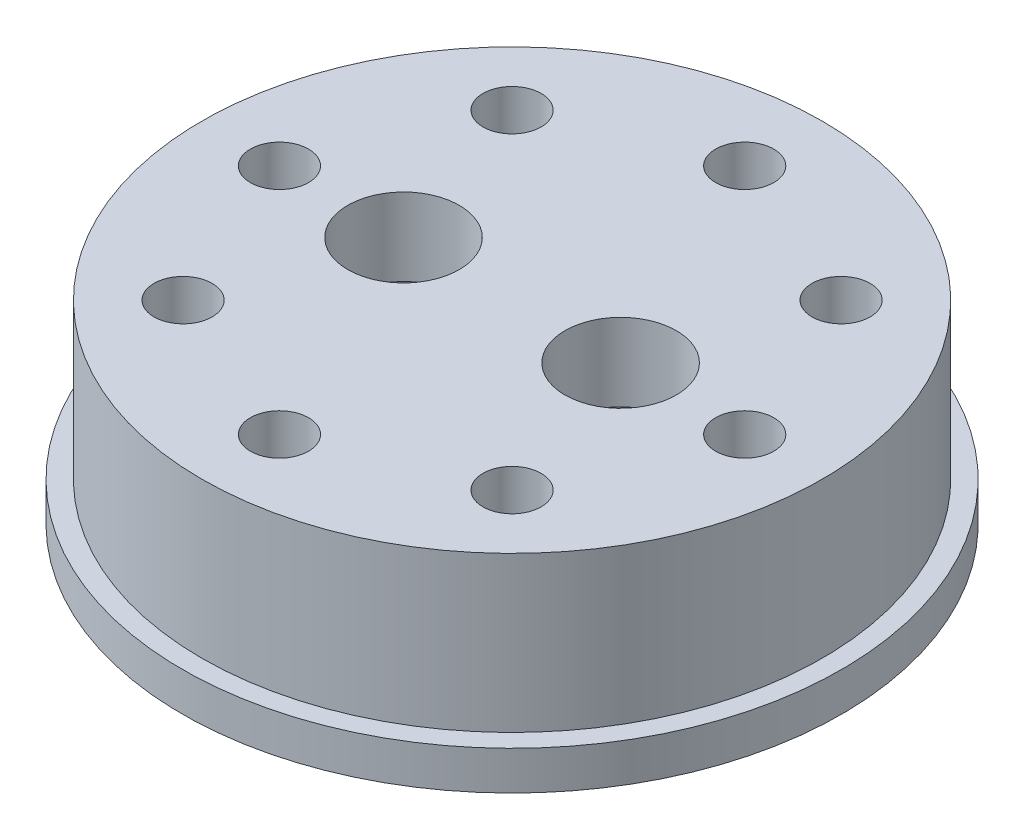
ISO-10303-21;
HEADER;
FILE_DESCRIPTION(('STEP AP214'),'2;1');
FILE_NAME('part.step','',(''),(''),'','','');
FILE_SCHEMA(('AUTOMOTIVE_DESIGN { 1 0 10303 214 1 1 1 1 }'));
ENDSEC;
DATA;
#1=APPLICATION_CONTEXT('core data for automotive mechanical design processes');
#2=APPLICATION_PROTOCOL_DEFINITION('international standard','automotive_design',2000,#1);
#3=PRODUCT_CONTEXT('',#1,'mechanical');
#4=PRODUCT('Part','Part','',(#3));
#5=PRODUCT_RELATED_PRODUCT_CATEGORY('part','',(#4));
#6=PRODUCT_DEFINITION_FORMATION('','',#4);
#7=PRODUCT_DEFINITION_CONTEXT('part definition',#1,'design');
#8=PRODUCT_DEFINITION('design','',#6,#7);
#9=PRODUCT_DEFINITION_SHAPE('','',#8);
#10=(LENGTH_UNIT() NAMED_UNIT(*) SI_UNIT(.MILLI.,.METRE.));
#11=(NAMED_UNIT(*) PLANE_ANGLE_UNIT() SI_UNIT($,.RADIAN.));
#12=(NAMED_UNIT(*) SI_UNIT($,.STERADIAN.) SOLID_ANGLE_UNIT());
#13=UNCERTAINTY_MEASURE_WITH_UNIT(LENGTH_MEASURE(1.E-05),#10,'distance_accuracy_value','');
#14=(GEOMETRIC_REPRESENTATION_CONTEXT(3) GLOBAL_UNCERTAINTY_ASSIGNED_CONTEXT((#13)) GLOBAL_UNIT_ASSIGNED_CONTEXT((#10,
#11,#12)) REPRESENTATION_CONTEXT('',''));
#15=CARTESIAN_POINT('',(0.,0.,0.));
#16=DIRECTION('',(0.,0.,1.));
#17=DIRECTION('',(1.,0.,0.));
#18=AXIS2_PLACEMENT_3D('',#15,#16,#17);
#19=CARTESIAN_POINT('',(0.,31.75,0.));
#20=DIRECTION('',(0.,-1.,0.));
#21=DIRECTION('',(0.,0.,-1.));
#22=AXIS2_PLACEMENT_3D('',#19,#20,#21);
#23=CYLINDRICAL_SURFACE('',#22,30.48);
#24=DIRECTION('',(0.,-1.,0.));
#25=VECTOR('',#24,1.);
#26=CARTESIAN_POINT('',(-9.906,31.75,-28.8253632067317));
#27=LINE('',#26,#25);
#28=CARTESIAN_POINT('',(-9.906,0.,-28.8253632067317));
#29=VERTEX_POINT('',#28);
#30=CARTESIAN_POINT('',(-9.906,19.05,-28.8253632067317));
#31=VERTEX_POINT('',#30);
#32=EDGE_CURVE('E289',#29,#31,#27,.F.);
#33=ORIENTED_EDGE('',*,*,#32,.T.);
#34=CARTESIAN_POINT('',(0.,19.05,0.));
#35=DIRECTION('',(0.,1.,0.));
#36=DIRECTION('',(0.,0.,1.));
#37=AXIS2_PLACEMENT_3D('',#34,#35,#36);
#38=CIRCLE('',#37,30.48);
#39=CARTESIAN_POINT('',(-9.906,19.05,28.8253632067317));
#40=VERTEX_POINT('',#39);
#41=EDGE_CURVE('E179',#31,#40,#38,.T.);
#42=ORIENTED_EDGE('',*,*,#41,.T.);
#43=DIRECTION('',(0.,-1.,0.));
#44=VECTOR('',#43,1.);
#45=CARTESIAN_POINT('',(-9.906,31.75,28.8253632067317));
#46=LINE('',#45,#44);
#47=CARTESIAN_POINT('',(-9.906,0.,28.8253632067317));
#48=VERTEX_POINT('',#47);
#49=EDGE_CURVE('E293',#40,#48,#46,.T.);
#50=ORIENTED_EDGE('',*,*,#49,.T.);
#51=CARTESIAN_POINT('',(0.,0.,0.));
#52=DIRECTION('',(0.,1.,0.));
#53=DIRECTION('',(0.,0.,1.));
#54=AXIS2_PLACEMENT_3D('',#51,#52,#53);
#55=CIRCLE('',#54,30.48);
#56=EDGE_CURVE('E270',#29,#48,#55,.T.);
#57=ORIENTED_EDGE('',*,*,#56,.F.);
#58=EDGE_LOOP('',(#33,#42,#50,#57));
#59=FACE_BOUND('',#58,.T.);
#60=ADVANCED_FACE('F72',(#59),#23,.F.);
#61=DIRECTION('',(0.,-1.,0.));
#62=VECTOR('',#61,1.);
#63=CARTESIAN_POINT('',(9.906,31.75,28.8253632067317));
#64=LINE('',#63,#62);
#65=CARTESIAN_POINT('',(9.906,0.,28.8253632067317));
#66=VERTEX_POINT('',#65);
#67=CARTESIAN_POINT('',(9.906,19.05,28.8253632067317));
#68=VERTEX_POINT('',#67);
#69=EDGE_CURVE('E149',#66,#68,#64,.F.);
#70=ORIENTED_EDGE('',*,*,#69,.T.);
#71=CARTESIAN_POINT('',(0.,19.05,0.));
#72=DIRECTION('',(0.,1.,0.));
#73=DIRECTION('',(0.,0.,1.));
#74=AXIS2_PLACEMENT_3D('',#71,#72,#73);
#75=CIRCLE('',#74,30.48);
#76=CARTESIAN_POINT('',(9.906,19.05,-28.8253632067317));
#77=VERTEX_POINT('',#76);
#78=EDGE_CURVE('E153',#68,#77,#75,.T.);
#79=ORIENTED_EDGE('',*,*,#78,.T.);
#80=DIRECTION('',(0.,-1.,0.));
#81=VECTOR('',#80,1.);
#82=CARTESIAN_POINT('',(9.906,31.75,-28.8253632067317));
#83=LINE('',#82,#81);
#84=CARTESIAN_POINT('',(9.906,0.,-28.8253632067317));
#85=VERTEX_POINT('',#84);
#86=EDGE_CURVE('E141',#77,#85,#83,.T.);
#87=ORIENTED_EDGE('',*,*,#86,.T.);
#88=EDGE_CURVE('E208',#66,#85,#55,.T.);
#89=ORIENTED_EDGE('',*,*,#88,.F.);
#90=EDGE_LOOP('',(#70,#79,#87,#89));
#91=FACE_BOUND('',#90,.T.);
#92=ADVANCED_FACE('F154',(#91),#23,.F.);
#93=CARTESIAN_POINT('',(3.175,0.,0.));
#94=DIRECTION('',(1.,0.,0.));
#95=DIRECTION('',(0.,0.,-1.));
#96=AXIS2_PLACEMENT_3D('',#93,#94,#95);
#97=PLANE('',#96);
#98=DIRECTION('',(0.,1.,0.));
#99=VECTOR('',#98,1.);
#100=CARTESIAN_POINT('',(3.175,31.75,-24.0211360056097));
#101=LINE('',#100,#99);
#102=CARTESIAN_POINT('',(3.175,0.,-24.0211360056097));
#103=VERTEX_POINT('',#102);
#104=CARTESIAN_POINT('',(3.175,19.05,-24.0211360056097));
#105=VERTEX_POINT('',#104);
#106=EDGE_CURVE('E276',#103,#105,#101,.T.);
#107=ORIENTED_EDGE('',*,*,#106,.T.);
#108=DIRECTION('',(0.,0.,1.));
#109=VECTOR('',#108,1.);
#110=CARTESIAN_POINT('',(3.175,19.05,0.));
#111=LINE('',#110,#109);
#112=CARTESIAN_POINT('',(3.175,19.05,24.0211360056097));
#113=VERTEX_POINT('',#112);
#114=EDGE_CURVE('E98',#105,#113,#111,.T.);
#115=ORIENTED_EDGE('',*,*,#114,.T.);
#116=DIRECTION('',(0.,1.,0.));
#117=VECTOR('',#116,1.);
#118=CARTESIAN_POINT('',(3.175,0.,24.0211360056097));
#119=LINE('',#118,#117);
#120=CARTESIAN_POINT('',(3.175,0.,24.0211360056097));
#121=VERTEX_POINT('',#120);
#122=EDGE_CURVE('E279',#113,#121,#119,.F.);
#123=ORIENTED_EDGE('',*,*,#122,.T.);
#124=DIRECTION('',(0.,0.,-1.));
#125=VECTOR('',#124,1.);
#126=CARTESIAN_POINT('',(3.175,0.,0.));
#127=LINE('',#126,#125);
#128=EDGE_CURVE('E195',#121,#103,#127,.T.);
#129=ORIENTED_EDGE('',*,*,#128,.T.);
#130=EDGE_LOOP('',(#107,#115,#123,#129));
#131=FACE_BOUND('',#130,.T.);
#132=ADVANCED_FACE('F336',(#131),#97,.T.);
#133=CARTESIAN_POINT('',(-3.175,0.,30.3141843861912));
#134=DIRECTION('',(1.,0.,0.));
#135=DIRECTION('',(0.,0.,-1.));
#136=AXIS2_PLACEMENT_3D('',#133,#134,#135);
#137=PLANE('',#136);
#138=DIRECTION('',(0.,0.,1.));
#139=VECTOR('',#138,1.);
#140=CARTESIAN_POINT('',(-3.175,19.05,30.3141843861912));
#141=LINE('',#140,#139);
#142=CARTESIAN_POINT('',(-3.175,19.05,-24.0211360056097));
#143=VERTEX_POINT('',#142);
#144=CARTESIAN_POINT('',(-3.175,19.05,24.0211360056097));
#145=VERTEX_POINT('',#144);
#146=EDGE_CURVE('E175',#143,#145,#141,.T.);
#147=ORIENTED_EDGE('',*,*,#146,.F.);
#148=DIRECTION('',(0.,-1.,0.));
#149=VECTOR('',#148,1.);
#150=CARTESIAN_POINT('',(-3.175,0.,-24.0211360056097));
#151=LINE('',#150,#149);
#152=CARTESIAN_POINT('',(-3.175,0.,-24.0211360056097));
#153=VERTEX_POINT('',#152);
#154=EDGE_CURVE('E282',#143,#153,#151,.T.);
#155=ORIENTED_EDGE('',*,*,#154,.T.);
#156=DIRECTION('',(0.,0.,-1.));
#157=VECTOR('',#156,1.);
#158=CARTESIAN_POINT('',(-3.175,0.,30.3141843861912));
#159=LINE('',#158,#157);
#160=CARTESIAN_POINT('',(-3.175,0.,24.0211360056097));
#161=VERTEX_POINT('',#160);
#162=EDGE_CURVE('E191',#161,#153,#159,.T.);
#163=ORIENTED_EDGE('',*,*,#162,.F.);
#164=DIRECTION('',(0.,-1.,0.));
#165=VECTOR('',#164,1.);
#166=CARTESIAN_POINT('',(-3.175,0.,24.0211360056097));
#167=LINE('',#166,#165);
#168=EDGE_CURVE('E285',#161,#145,#167,.F.);
#169=ORIENTED_EDGE('',*,*,#168,.T.);
#170=EDGE_LOOP('',(#147,#155,#163,#169));
#171=FACE_BOUND('',#170,.T.);
#172=ADVANCED_FACE('F370',(#171),#137,.F.);
#173=CARTESIAN_POINT('',(8.255,31.75,24.0211360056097));
#174=DIRECTION('',(0.,-1.,0.));
#175=DIRECTION('',(0.,0.,-1.));
#176=AXIS2_PLACEMENT_3D('',#173,#174,#175);
#177=CYLINDRICAL_SURFACE('',#176,5.08);
#178=CARTESIAN_POINT('',(8.255,19.05,24.0211360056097));
#179=DIRECTION('',(0.,1.,0.));
#180=DIRECTION('',(0.,0.,1.));
#181=AXIS2_PLACEMENT_3D('',#178,#179,#180);
#182=CIRCLE('',#181,5.08);
#183=EDGE_CURVE('E90',#68,#113,#182,.F.);
#184=ORIENTED_EDGE('',*,*,#183,.F.);
#185=ORIENTED_EDGE('',*,*,#69,.F.);
#186=CARTESIAN_POINT('',(8.255,0.,24.0211360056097));
#187=DIRECTION('',(0.,1.,0.));
#188=DIRECTION('',(0.,0.,1.));
#189=AXIS2_PLACEMENT_3D('',#186,#187,#188);
#190=CIRCLE('',#189,5.08);
#191=EDGE_CURVE('E296',#121,#66,#190,.T.);
#192=ORIENTED_EDGE('',*,*,#191,.F.);
#193=ORIENTED_EDGE('',*,*,#122,.F.);
#194=EDGE_LOOP('',(#184,#185,#192,#193));
#195=FACE_BOUND('',#194,.T.);
#196=ADVANCED_FACE('F366',(#195),#177,.F.);
#197=CARTESIAN_POINT('',(-8.255,31.75,24.0211360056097));
#198=DIRECTION('',(0.,-1.,0.));
#199=DIRECTION('',(0.,0.,-1.));
#200=AXIS2_PLACEMENT_3D('',#197,#198,#199);
#201=CYLINDRICAL_SURFACE('',#200,5.08);
#202=CARTESIAN_POINT('',(-8.255,19.05,24.0211360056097));
#203=DIRECTION('',(0.,1.,0.));
#204=DIRECTION('',(0.,0.,1.));
#205=AXIS2_PLACEMENT_3D('',#202,#203,#204);
#206=CIRCLE('',#205,5.08);
#207=EDGE_CURVE('E182',#145,#40,#206,.F.);
#208=ORIENTED_EDGE('',*,*,#207,.F.);
#209=ORIENTED_EDGE('',*,*,#168,.F.);
#210=CARTESIAN_POINT('',(-8.255,0.,24.0211360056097));
#211=DIRECTION('',(0.,1.,0.));
#212=DIRECTION('',(0.,0.,1.));
#213=AXIS2_PLACEMENT_3D('',#210,#211,#212);
#214=CIRCLE('',#213,5.08);
#215=EDGE_CURVE('E299',#48,#161,#214,.T.);
#216=ORIENTED_EDGE('',*,*,#215,.F.);
#217=ORIENTED_EDGE('',*,*,#49,.F.);
#218=EDGE_LOOP('',(#208,#209,#216,#217));
#219=FACE_BOUND('',#218,.T.);
#220=ADVANCED_FACE('F369',(#219),#201,.F.);
#221=CARTESIAN_POINT('',(-8.255,31.75,-24.0211360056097));
#222=DIRECTION('',(0.,-1.,0.));
#223=DIRECTION('',(0.,0.,-1.));
#224=AXIS2_PLACEMENT_3D('',#221,#222,#223);
#225=CYLINDRICAL_SURFACE('',#224,5.08);
#226=CARTESIAN_POINT('',(-8.255,19.05,-24.0211360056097));
#227=DIRECTION('',(0.,1.,0.));
#228=DIRECTION('',(0.,0.,1.));
#229=AXIS2_PLACEMENT_3D('',#226,#227,#228);
#230=CIRCLE('',#229,5.08);
#231=EDGE_CURVE('E171',#31,#143,#230,.F.);
#232=ORIENTED_EDGE('',*,*,#231,.F.);
#233=ORIENTED_EDGE('',*,*,#32,.F.);
#234=CARTESIAN_POINT('',(-8.255,0.,-24.0211360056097));
#235=DIRECTION('',(0.,1.,0.));
#236=DIRECTION('',(0.,0.,1.));
#237=AXIS2_PLACEMENT_3D('',#234,#235,#236);
#238=CIRCLE('',#237,5.08);
#239=EDGE_CURVE('E302',#153,#29,#238,.T.);
#240=ORIENTED_EDGE('',*,*,#239,.F.);
#241=ORIENTED_EDGE('',*,*,#154,.F.);
#242=EDGE_LOOP('',(#232,#233,#240,#241));
#243=FACE_BOUND('',#242,.T.);
#244=ADVANCED_FACE('F327',(#243),#225,.F.);
#245=CARTESIAN_POINT('',(8.255,31.75,-24.0211360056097));
#246=DIRECTION('',(0.,-1.,0.));
#247=DIRECTION('',(0.,0.,-1.));
#248=AXIS2_PLACEMENT_3D('',#245,#246,#247);
#249=CYLINDRICAL_SURFACE('',#248,5.08);
#250=CARTESIAN_POINT('',(8.255,19.05,-24.0211360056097));
#251=DIRECTION('',(0.,1.,0.));
#252=DIRECTION('',(0.,0.,1.));
#253=AXIS2_PLACEMENT_3D('',#250,#251,#252);
#254=CIRCLE('',#253,5.08);
#255=EDGE_CURVE('E12',#105,#77,#254,.F.);
#256=ORIENTED_EDGE('',*,*,#255,.F.);
#257=ORIENTED_EDGE('',*,*,#106,.F.);
#258=CARTESIAN_POINT('',(8.255,0.,-24.0211360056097));
#259=DIRECTION('',(0.,1.,0.));
#260=DIRECTION('',(0.,0.,1.));
#261=AXIS2_PLACEMENT_3D('',#258,#259,#260);
#262=CIRCLE('',#261,5.08);
#263=EDGE_CURVE('E144',#85,#103,#262,.T.);
#264=ORIENTED_EDGE('',*,*,#263,.F.);
#265=ORIENTED_EDGE('',*,*,#86,.F.);
#266=EDGE_LOOP('',(#256,#257,#264,#265));
#267=FACE_BOUND('',#266,.T.);
#268=ADVANCED_FACE('F74',(#267),#249,.F.);
#269=CARTESIAN_POINT('',(0.,31.75,0.));
#270=DIRECTION('',(0.,-1.,0.));
#271=DIRECTION('',(0.,0.,-1.));
#272=AXIS2_PLACEMENT_3D('',#269,#270,#271);
#273=CYLINDRICAL_SURFACE('',#272,50.8);
#274=CARTESIAN_POINT('',(0.,31.75,0.));
#275=DIRECTION('',(0.,1.,0.));
#276=DIRECTION('',(0.,0.,1.));
#277=AXIS2_PLACEMENT_3D('',#274,#275,#276);
#278=CIRCLE('',#277,50.8);
#279=CARTESIAN_POINT('',(0.,31.75,50.8));
#280=VERTEX_POINT('',#279);
#281=EDGE_CURVE('E150',#280,#280,#278,.T.);
#282=ORIENTED_EDGE('',*,*,#281,.F.);
#283=EDGE_LOOP('',(#282));
#284=FACE_BOUND('',#283,.T.);
#285=CARTESIAN_POINT('',(0.,6.35,0.));
#286=DIRECTION('',(0.,-1.,0.));
#287=DIRECTION('',(0.,0.,-1.));
#288=AXIS2_PLACEMENT_3D('',#285,#286,#287);
#289=CIRCLE('',#288,50.8);
#290=CARTESIAN_POINT('',(0.,6.35,-50.8));
#291=VERTEX_POINT('',#290);
#292=EDGE_CURVE('E82',#291,#291,#289,.T.);
#293=ORIENTED_EDGE('',*,*,#292,.F.);
#294=EDGE_LOOP('',(#293));
#295=FACE_BOUND('',#294,.T.);
#296=ADVANCED_FACE('F315',(#284,#295),#273,.T.);
#297=CARTESIAN_POINT('',(-26.940768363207,31.75,-26.9407683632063));
#298=DIRECTION('',(0.,-1.,0.));
#299=DIRECTION('',(0.,0.,-1.));
#300=AXIS2_PLACEMENT_3D('',#297,#298,#299);
#301=CYLINDRICAL_SURFACE('',#300,4.76250000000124);
#302=CARTESIAN_POINT('',(-26.940768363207,31.75,-26.9407683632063));
#303=DIRECTION('',(0.,1.,0.));
#304=DIRECTION('',(0.,0.,1.));
#305=AXIS2_PLACEMENT_3D('',#302,#303,#304);
#306=CIRCLE('',#305,4.76250000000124);
#307=CARTESIAN_POINT('',(-26.940768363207,31.75,-22.1782683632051));
#308=VERTEX_POINT('',#307);
#309=EDGE_CURVE('E232',#308,#308,#306,.T.);
#310=ORIENTED_EDGE('',*,*,#309,.T.);
#311=EDGE_LOOP('',(#310));
#312=FACE_BOUND('',#311,.T.);
#313=CARTESIAN_POINT('',(-26.940768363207,0.,-26.9407683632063));
#314=DIRECTION('',(0.,1.,0.));
#315=DIRECTION('',(0.,0.,1.));
#316=AXIS2_PLACEMENT_3D('',#313,#314,#315);
#317=CIRCLE('',#316,4.76250000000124);
#318=CARTESIAN_POINT('',(-26.940768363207,0.,-22.1782683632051));
#319=VERTEX_POINT('',#318);
#320=EDGE_CURVE('E266',#319,#319,#317,.T.);
#321=ORIENTED_EDGE('',*,*,#320,.F.);
#322=EDGE_LOOP('',(#321));
#323=FACE_BOUND('',#322,.T.);
#324=ADVANCED_FACE('F317',(#312,#323),#301,.F.);
#325=CARTESIAN_POINT('',(0.,31.75,-38.1));
#326=DIRECTION('',(0.,-1.,0.));
#327=DIRECTION('',(0.,0.,-1.));
#328=AXIS2_PLACEMENT_3D('',#325,#326,#327);
#329=CYLINDRICAL_SURFACE('',#328,4.7625);
#330=CARTESIAN_POINT('',(0.,31.75,-38.1));
#331=DIRECTION('',(0.,1.,0.));
#332=DIRECTION('',(0.,0.,1.));
#333=AXIS2_PLACEMENT_3D('',#330,#331,#332);
#334=CIRCLE('',#333,4.7625);
#335=CARTESIAN_POINT('',(0.,31.75,-33.3375));
#336=VERTEX_POINT('',#335);
#337=EDGE_CURVE('E228',#336,#336,#334,.T.);
#338=ORIENTED_EDGE('',*,*,#337,.T.);
#339=EDGE_LOOP('',(#338));
#340=FACE_BOUND('',#339,.T.);
#341=CARTESIAN_POINT('',(0.,0.,-38.1));
#342=DIRECTION('',(0.,1.,0.));
#343=DIRECTION('',(0.,0.,1.));
#344=AXIS2_PLACEMENT_3D('',#341,#342,#343);
#345=CIRCLE('',#344,4.7625);
#346=CARTESIAN_POINT('',(0.,0.,-33.3375));
#347=VERTEX_POINT('',#346);
#348=EDGE_CURVE('E262',#347,#347,#345,.T.);
#349=ORIENTED_EDGE('',*,*,#348,.F.);
#350=EDGE_LOOP('',(#349));
#351=FACE_BOUND('',#350,.T.);
#352=ADVANCED_FACE('F324',(#340,#351),#329,.F.);
#353=CARTESIAN_POINT('',(26.9407683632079,31.75,-26.9407683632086));
#354=DIRECTION('',(0.,-1.,0.));
#355=DIRECTION('',(0.,0.,-1.));
#356=AXIS2_PLACEMENT_3D('',#353,#354,#355);
#357=CYLINDRICAL_SURFACE('',#356,4.76250000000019);
#358=CARTESIAN_POINT('',(26.9407683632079,31.75,-26.9407683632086));
#359=DIRECTION('',(0.,1.,0.));
#360=DIRECTION('',(0.,0.,1.));
#361=AXIS2_PLACEMENT_3D('',#358,#359,#360);
#362=CIRCLE('',#361,4.76250000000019);
#363=CARTESIAN_POINT('',(26.9407683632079,31.75,-22.1782683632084));
#364=VERTEX_POINT('',#363);
#365=EDGE_CURVE('E224',#364,#364,#362,.T.);
#366=ORIENTED_EDGE('',*,*,#365,.T.);
#367=EDGE_LOOP('',(#366));
#368=FACE_BOUND('',#367,.T.);
#369=CARTESIAN_POINT('',(26.9407683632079,0.,-26.9407683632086));
#370=DIRECTION('',(0.,1.,0.));
#371=DIRECTION('',(0.,0.,1.));
#372=AXIS2_PLACEMENT_3D('',#369,#370,#371);
#373=CIRCLE('',#372,4.76250000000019);
#374=CARTESIAN_POINT('',(26.9407683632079,0.,-22.1782683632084));
#375=VERTEX_POINT('',#374);
#376=EDGE_CURVE('E258',#375,#375,#373,.T.);
#377=ORIENTED_EDGE('',*,*,#376,.F.);
#378=EDGE_LOOP('',(#377));
#379=FACE_BOUND('',#378,.T.);
#380=ADVANCED_FACE('F340',(#368,#379),#357,.F.);
#381=CARTESIAN_POINT('',(38.1000000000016,31.75,-1.61730183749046E-12));
#382=DIRECTION('',(0.,-1.,0.));
#383=DIRECTION('',(0.,0.,-1.));
#384=AXIS2_PLACEMENT_3D('',#381,#382,#383);
#385=CYLINDRICAL_SURFACE('',#384,4.7625000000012);
#386=CARTESIAN_POINT('',(38.1000000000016,31.75,-1.61730183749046E-12));
#387=DIRECTION('',(0.,1.,0.));
#388=DIRECTION('',(0.,0.,1.));
#389=AXIS2_PLACEMENT_3D('',#386,#387,#388);
#390=CIRCLE('',#389,4.7625000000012);
#391=CARTESIAN_POINT('',(38.1000000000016,31.75,4.76249999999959));
#392=VERTEX_POINT('',#391);
#393=EDGE_CURVE('E220',#392,#392,#390,.T.);
#394=ORIENTED_EDGE('',*,*,#393,.T.);
#395=EDGE_LOOP('',(#394));
#396=FACE_BOUND('',#395,.T.);
#397=CARTESIAN_POINT('',(38.1000000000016,0.,-1.61730183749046E-12));
#398=DIRECTION('',(0.,1.,0.));
#399=DIRECTION('',(0.,0.,1.));
#400=AXIS2_PLACEMENT_3D('',#397,#398,#399);
#401=CIRCLE('',#400,4.7625000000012);
#402=CARTESIAN_POINT('',(38.1000000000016,0.,4.76249999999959));
#403=VERTEX_POINT('',#402);
#404=EDGE_CURVE('E254',#403,#403,#401,.T.);
#405=ORIENTED_EDGE('',*,*,#404,.F.);
#406=EDGE_LOOP('',(#405));
#407=FACE_BOUND('',#406,.T.);
#408=ADVANCED_FACE('F344',(#396,#407),#385,.F.);
#409=CARTESIAN_POINT('',(26.9407683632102,31.75,26.9407683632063));
#410=DIRECTION('',(0.,-1.,0.));
#411=DIRECTION('',(0.,0.,-1.));
#412=AXIS2_PLACEMENT_3D('',#409,#410,#411);
#413=CYLINDRICAL_SURFACE('',#412,4.7625000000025);
#414=CARTESIAN_POINT('',(26.9407683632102,31.75,26.9407683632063));
#415=DIRECTION('',(0.,1.,0.));
#416=DIRECTION('',(0.,0.,1.));
#417=AXIS2_PLACEMENT_3D('',#414,#415,#416);
#418=CIRCLE('',#417,4.7625000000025);
#419=CARTESIAN_POINT('',(26.9407683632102,31.75,31.7032683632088));
#420=VERTEX_POINT('',#419);
#421=EDGE_CURVE('E216',#420,#420,#418,.T.);
#422=ORIENTED_EDGE('',*,*,#421,.T.);
#423=EDGE_LOOP('',(#422));
#424=FACE_BOUND('',#423,.T.);
#425=CARTESIAN_POINT('',(26.9407683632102,0.,26.9407683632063));
#426=DIRECTION('',(0.,1.,0.));
#427=DIRECTION('',(0.,0.,1.));
#428=AXIS2_PLACEMENT_3D('',#425,#426,#427);
#429=CIRCLE('',#428,4.7625000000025);
#430=CARTESIAN_POINT('',(26.9407683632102,0.,31.7032683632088));
#431=VERTEX_POINT('',#430);
#432=EDGE_CURVE('E250',#431,#431,#429,.T.);
#433=ORIENTED_EDGE('',*,*,#432,.F.);
#434=EDGE_LOOP('',(#433));
#435=FACE_BOUND('',#434,.T.);
#436=ADVANCED_FACE('F348',(#424,#435),#413,.F.);
#437=CARTESIAN_POINT('',(3.23460367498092E-12,31.75,38.1));
#438=DIRECTION('',(0.,-1.,0.));
#439=DIRECTION('',(0.,0.,-1.));
#440=AXIS2_PLACEMENT_3D('',#437,#438,#439);
#441=CYLINDRICAL_SURFACE('',#440,4.76250000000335);
#442=CARTESIAN_POINT('',(3.23460367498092E-12,31.75,38.1));
#443=DIRECTION('',(0.,1.,0.));
#444=DIRECTION('',(0.,0.,1.));
#445=AXIS2_PLACEMENT_3D('',#442,#443,#444);
#446=CIRCLE('',#445,4.76250000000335);
#447=CARTESIAN_POINT('',(3.23460367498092E-12,31.75,42.8625000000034));
#448=VERTEX_POINT('',#447);
#449=EDGE_CURVE('E212',#448,#448,#446,.T.);
#450=ORIENTED_EDGE('',*,*,#449,.T.);
#451=EDGE_LOOP('',(#450));
#452=FACE_BOUND('',#451,.T.);
#453=CARTESIAN_POINT('',(3.23460367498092E-12,0.,38.1));
#454=DIRECTION('',(0.,1.,0.));
#455=DIRECTION('',(0.,0.,1.));
#456=AXIS2_PLACEMENT_3D('',#453,#454,#455);
#457=CIRCLE('',#456,4.76250000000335);
#458=CARTESIAN_POINT('',(3.23460367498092E-12,0.,42.8625000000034));
#459=VERTEX_POINT('',#458);
#460=EDGE_CURVE('E246',#459,#459,#457,.T.);
#461=ORIENTED_EDGE('',*,*,#460,.F.);
#462=EDGE_LOOP('',(#461));
#463=FACE_BOUND('',#462,.T.);
#464=ADVANCED_FACE('F352',(#452,#463),#441,.F.);
#465=CARTESIAN_POINT('',(-26.9407683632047,31.75,26.9407683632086));
#466=DIRECTION('',(0.,-1.,0.));
#467=DIRECTION('',(0.,0.,-1.));
#468=AXIS2_PLACEMENT_3D('',#465,#466,#467);
#469=CYLINDRICAL_SURFACE('',#468,4.76250000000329);
#470=CARTESIAN_POINT('',(-26.9407683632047,31.75,26.9407683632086));
#471=DIRECTION('',(0.,1.,0.));
#472=DIRECTION('',(0.,0.,1.));
#473=AXIS2_PLACEMENT_3D('',#470,#471,#472);
#474=CIRCLE('',#473,4.76250000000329);
#475=CARTESIAN_POINT('',(-26.9407683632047,31.75,31.7032683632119));
#476=VERTEX_POINT('',#475);
#477=EDGE_CURVE('E207',#476,#476,#474,.T.);
#478=ORIENTED_EDGE('',*,*,#477,.T.);
#479=EDGE_LOOP('',(#478));
#480=FACE_BOUND('',#479,.T.);
#481=CARTESIAN_POINT('',(-26.9407683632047,0.,26.9407683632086));
#482=DIRECTION('',(0.,1.,0.));
#483=DIRECTION('',(0.,0.,1.));
#484=AXIS2_PLACEMENT_3D('',#481,#482,#483);
#485=CIRCLE('',#484,4.76250000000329);
#486=CARTESIAN_POINT('',(-26.9407683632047,0.,31.7032683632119));
#487=VERTEX_POINT('',#486);
#488=EDGE_CURVE('E242',#487,#487,#485,.T.);
#489=ORIENTED_EDGE('',*,*,#488,.F.);
#490=EDGE_LOOP('',(#489));
#491=FACE_BOUND('',#490,.T.);
#492=ADVANCED_FACE('F356',(#480,#491),#469,.F.);
#493=CARTESIAN_POINT('',(-38.0999999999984,31.75,1.62196774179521E-12));
#494=DIRECTION('',(0.,-1.,0.));
#495=DIRECTION('',(0.,0.,-1.));
#496=AXIS2_PLACEMENT_3D('',#493,#494,#495);
#497=CYLINDRICAL_SURFACE('',#496,4.76250000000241);
#498=CARTESIAN_POINT('',(-38.0999999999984,31.75,1.62196774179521E-12));
#499=DIRECTION('',(0.,1.,0.));
#500=DIRECTION('',(0.,0.,1.));
#501=AXIS2_PLACEMENT_3D('',#498,#499,#500);
#502=CIRCLE('',#501,4.76250000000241);
#503=CARTESIAN_POINT('',(-38.0999999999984,31.75,4.76250000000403));
#504=VERTEX_POINT('',#503);
#505=EDGE_CURVE('E203',#504,#504,#502,.T.);
#506=ORIENTED_EDGE('',*,*,#505,.T.);
#507=EDGE_LOOP('',(#506));
#508=FACE_BOUND('',#507,.T.);
#509=CARTESIAN_POINT('',(-38.0999999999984,0.,1.62196774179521E-12));
#510=DIRECTION('',(0.,1.,0.));
#511=DIRECTION('',(0.,0.,1.));
#512=AXIS2_PLACEMENT_3D('',#509,#510,#511);
#513=CIRCLE('',#512,4.76250000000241);
#514=CARTESIAN_POINT('',(-38.0999999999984,0.,4.76250000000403));
#515=VERTEX_POINT('',#514);
#516=EDGE_CURVE('E199',#515,#515,#513,.T.);
#517=ORIENTED_EDGE('',*,*,#516,.F.);
#518=EDGE_LOOP('',(#517));
#519=FACE_BOUND('',#518,.T.);
#520=ADVANCED_FACE('F360',(#508,#519),#497,.F.);
#521=CARTESIAN_POINT('',(0.,31.75,0.));
#522=DIRECTION('',(0.,1.,0.));
#523=DIRECTION('',(0.,0.,1.));
#524=AXIS2_PLACEMENT_3D('',#521,#522,#523);
#525=PLANE('',#524);
#526=CARTESIAN_POINT('',(-17.78,31.75,0.));
#527=DIRECTION('',(0.,1.,0.));
#528=DIRECTION('',(0.,0.,1.));
#529=AXIS2_PLACEMENT_3D('',#526,#527,#528);
#530=CIRCLE('',#529,9.128125);
#531=CARTESIAN_POINT('',(-17.78,31.75,9.128125));
#532=VERTEX_POINT('',#531);
#533=EDGE_CURVE('E435',#532,#532,#530,.T.);
#534=ORIENTED_EDGE('',*,*,#533,.F.);
#535=EDGE_LOOP('',(#534));
#536=FACE_BOUND('',#535,.T.);
#537=CARTESIAN_POINT('',(17.78,31.75,0.));
#538=DIRECTION('',(0.,1.,0.));
#539=DIRECTION('',(0.,0.,1.));
#540=AXIS2_PLACEMENT_3D('',#537,#538,#539);
#541=CIRCLE('',#540,9.12812499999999);
#542=CARTESIAN_POINT('',(17.78,31.75,9.12812499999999));
#543=VERTEX_POINT('',#542);
#544=EDGE_CURVE('E165',#543,#543,#541,.T.);
#545=ORIENTED_EDGE('',*,*,#544,.F.);
#546=EDGE_LOOP('',(#545));
#547=FACE_BOUND('',#546,.T.);
#548=ORIENTED_EDGE('',*,*,#505,.F.);
#549=EDGE_LOOP('',(#548));
#550=FACE_BOUND('',#549,.T.);
#551=ORIENTED_EDGE('',*,*,#477,.F.);
#552=EDGE_LOOP('',(#551));
#553=FACE_BOUND('',#552,.T.);
#554=ORIENTED_EDGE('',*,*,#449,.F.);
#555=EDGE_LOOP('',(#554));
#556=FACE_BOUND('',#555,.T.);
#557=ORIENTED_EDGE('',*,*,#421,.F.);
#558=EDGE_LOOP('',(#557));
#559=FACE_BOUND('',#558,.T.);
#560=ORIENTED_EDGE('',*,*,#393,.F.);
#561=EDGE_LOOP('',(#560));
#562=FACE_BOUND('',#561,.T.);
#563=ORIENTED_EDGE('',*,*,#365,.F.);
#564=EDGE_LOOP('',(#563));
#565=FACE_BOUND('',#564,.T.);
#566=ORIENTED_EDGE('',*,*,#337,.F.);
#567=EDGE_LOOP('',(#566));
#568=FACE_BOUND('',#567,.T.);
#569=ORIENTED_EDGE('',*,*,#309,.F.);
#570=EDGE_LOOP('',(#569));
#571=FACE_BOUND('',#570,.T.);
#572=ORIENTED_EDGE('',*,*,#281,.T.);
#573=EDGE_LOOP('',(#572));
#574=FACE_BOUND('',#573,.T.);
#575=ADVANCED_FACE('F364',(#536,#547,#550,#553,#556,#559,#562,#565,#568,#571,#574),#525,.T.);
#576=CARTESIAN_POINT('',(0.,0.,0.));
#577=DIRECTION('',(0.,1.,0.));
#578=DIRECTION('',(0.,0.,1.));
#579=AXIS2_PLACEMENT_3D('',#576,#577,#578);
#580=PLANE('',#579);
#581=ORIENTED_EDGE('',*,*,#56,.T.);
#582=ORIENTED_EDGE('',*,*,#215,.T.);
#583=ORIENTED_EDGE('',*,*,#162,.T.);
#584=ORIENTED_EDGE('',*,*,#239,.T.);
#585=EDGE_LOOP('',(#581,#582,#583,#584));
#586=FACE_BOUND('',#585,.T.);
#587=ORIENTED_EDGE('',*,*,#320,.T.);
#588=EDGE_LOOP('',(#587));
#589=FACE_BOUND('',#588,.T.);
#590=ORIENTED_EDGE('',*,*,#348,.T.);
#591=EDGE_LOOP('',(#590));
#592=FACE_BOUND('',#591,.T.);
#593=ORIENTED_EDGE('',*,*,#376,.T.);
#594=EDGE_LOOP('',(#593));
#595=FACE_BOUND('',#594,.T.);
#596=ORIENTED_EDGE('',*,*,#404,.T.);
#597=EDGE_LOOP('',(#596));
#598=FACE_BOUND('',#597,.T.);
#599=ORIENTED_EDGE('',*,*,#432,.T.);
#600=EDGE_LOOP('',(#599));
#601=FACE_BOUND('',#600,.T.);
#602=ORIENTED_EDGE('',*,*,#460,.T.);
#603=EDGE_LOOP('',(#602));
#604=FACE_BOUND('',#603,.T.);
#605=ORIENTED_EDGE('',*,*,#488,.T.);
#606=EDGE_LOOP('',(#605));
#607=FACE_BOUND('',#606,.T.);
#608=ORIENTED_EDGE('',*,*,#516,.T.);
#609=EDGE_LOOP('',(#608));
#610=FACE_BOUND('',#609,.T.);
#611=ORIENTED_EDGE('',*,*,#128,.F.);
#612=ORIENTED_EDGE('',*,*,#191,.T.);
#613=ORIENTED_EDGE('',*,*,#88,.T.);
#614=ORIENTED_EDGE('',*,*,#263,.T.);
#615=EDGE_LOOP('',(#611,#612,#613,#614));
#616=FACE_BOUND('',#615,.T.);
#617=CARTESIAN_POINT('',(0.,0.,0.));
#618=DIRECTION('',(0.,-1.,0.));
#619=DIRECTION('',(0.,0.,-1.));
#620=AXIS2_PLACEMENT_3D('',#617,#618,#619);
#621=CIRCLE('',#620,53.975);
#622=CARTESIAN_POINT('',(0.,0.,-53.975));
#623=VERTEX_POINT('',#622);
#624=EDGE_CURVE('E186',#623,#623,#621,.T.);
#625=ORIENTED_EDGE('',*,*,#624,.T.);
#626=EDGE_LOOP('',(#625));
#627=FACE_BOUND('',#626,.T.);
#628=ADVANCED_FACE('F390',(#586,#589,#592,#595,#598,#601,#604,#607,#610,#616,#627),#580,.F.);
#629=CARTESIAN_POINT('',(0.,6.35,0.));
#630=DIRECTION('',(0.,-1.,0.));
#631=DIRECTION('',(0.,0.,-1.));
#632=AXIS2_PLACEMENT_3D('',#629,#630,#631);
#633=CYLINDRICAL_SURFACE('',#632,53.975);
#634=CARTESIAN_POINT('',(0.,6.35,0.));
#635=DIRECTION('',(0.,-1.,0.));
#636=DIRECTION('',(0.,0.,-1.));
#637=AXIS2_PLACEMENT_3D('',#634,#635,#636);
#638=CIRCLE('',#637,53.975);
#639=CARTESIAN_POINT('',(0.,6.35,-53.975));
#640=VERTEX_POINT('',#639);
#641=EDGE_CURVE('E187',#640,#640,#638,.T.);
#642=ORIENTED_EDGE('',*,*,#641,.T.);
#643=EDGE_LOOP('',(#642));
#644=FACE_BOUND('',#643,.T.);
#645=ORIENTED_EDGE('',*,*,#624,.F.);
#646=EDGE_LOOP('',(#645));
#647=FACE_BOUND('',#646,.T.);
#648=ADVANCED_FACE('F393',(#644,#647),#633,.T.);
#649=CARTESIAN_POINT('',(0.,6.35,0.));
#650=DIRECTION('',(0.,-1.,0.));
#651=DIRECTION('',(0.,0.,-1.));
#652=AXIS2_PLACEMENT_3D('',#649,#650,#651);
#653=PLANE('',#652);
#654=ORIENTED_EDGE('',*,*,#292,.T.);
#655=EDGE_LOOP('',(#654));
#656=FACE_BOUND('',#655,.T.);
#657=ORIENTED_EDGE('',*,*,#641,.F.);
#658=EDGE_LOOP('',(#657));
#659=FACE_BOUND('',#658,.T.);
#660=ADVANCED_FACE('F312',(#656,#659),#653,.F.);
#661=CARTESIAN_POINT('',(0.,19.05,0.));
#662=DIRECTION('',(0.,1.,0.));
#663=DIRECTION('',(0.,0.,1.));
#664=AXIS2_PLACEMENT_3D('',#661,#662,#663);
#665=PLANE('',#664);
#666=CARTESIAN_POINT('',(17.78,19.05,0.));
#667=DIRECTION('',(0.,1.,0.));
#668=DIRECTION('',(0.,0.,1.));
#669=AXIS2_PLACEMENT_3D('',#666,#667,#668);
#670=CIRCLE('',#669,9.12812499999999);
#671=CARTESIAN_POINT('',(17.78,19.05,9.12812499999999));
#672=VERTEX_POINT('',#671);
#673=EDGE_CURVE('E160',#672,#672,#670,.T.);
#674=ORIENTED_EDGE('',*,*,#673,.T.);
#675=EDGE_LOOP('',(#674));
#676=FACE_BOUND('',#675,.T.);
#677=ORIENTED_EDGE('',*,*,#78,.F.);
#678=ORIENTED_EDGE('',*,*,#183,.T.);
#679=ORIENTED_EDGE('',*,*,#114,.F.);
#680=ORIENTED_EDGE('',*,*,#255,.T.);
#681=EDGE_LOOP('',(#677,#678,#679,#680));
#682=FACE_BOUND('',#681,.T.);
#683=ADVANCED_FACE('F158',(#676,#682),#665,.F.);
#684=CARTESIAN_POINT('',(-17.78,19.05,0.));
#685=DIRECTION('',(0.,1.,0.));
#686=DIRECTION('',(0.,0.,1.));
#687=AXIS2_PLACEMENT_3D('',#684,#685,#686);
#688=CIRCLE('',#687,9.12812499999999);
#689=CARTESIAN_POINT('',(-17.78,19.05,9.12812499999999));
#690=VERTEX_POINT('',#689);
#691=EDGE_CURVE('E76',#690,#690,#688,.T.);
#692=ORIENTED_EDGE('',*,*,#691,.T.);
#693=EDGE_LOOP('',(#692));
#694=FACE_BOUND('',#693,.T.);
#695=ORIENTED_EDGE('',*,*,#146,.T.);
#696=ORIENTED_EDGE('',*,*,#207,.T.);
#697=ORIENTED_EDGE('',*,*,#41,.F.);
#698=ORIENTED_EDGE('',*,*,#231,.T.);
#699=EDGE_LOOP('',(#695,#696,#697,#698));
#700=FACE_BOUND('',#699,.T.);
#701=ADVANCED_FACE('F384',(#694,#700),#665,.F.);
#702=CARTESIAN_POINT('',(17.78,31.75,0.));
#703=DIRECTION('',(0.,1.,0.));
#704=DIRECTION('',(0.,0.,1.));
#705=AXIS2_PLACEMENT_3D('',#702,#703,#704);
#706=CYLINDRICAL_SURFACE('',#705,9.12812499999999);
#707=ORIENTED_EDGE('',*,*,#544,.T.);
#708=EDGE_LOOP('',(#707));
#709=FACE_BOUND('',#708,.T.);
#710=ORIENTED_EDGE('',*,*,#673,.F.);
#711=EDGE_LOOP('',(#710));
#712=FACE_BOUND('',#711,.T.);
#713=ADVANCED_FACE('F477',(#709,#712),#706,.F.);
#714=CARTESIAN_POINT('',(-17.78,31.75,0.));
#715=DIRECTION('',(0.,1.,0.));
#716=DIRECTION('',(0.,0.,1.));
#717=AXIS2_PLACEMENT_3D('',#714,#715,#716);
#718=CYLINDRICAL_SURFACE('',#717,9.12812499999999);
#719=ORIENTED_EDGE('',*,*,#533,.T.);
#720=EDGE_LOOP('',(#719));
#721=FACE_BOUND('',#720,.T.);
#722=ORIENTED_EDGE('',*,*,#691,.F.);
#723=EDGE_LOOP('',(#722));
#724=FACE_BOUND('',#723,.T.);
#725=ADVANCED_FACE('F474',(#721,#724),#718,.F.);
#726=CLOSED_SHELL('',(#60,#92,#132,#172,#196,#220,#244,#268,#296,#324,#352,#380,#408,#436,#464,
#492,#520,#575,#628,#648,#660,#683,#701,#713,#725));
#727=MANIFOLD_SOLID_BREP('B2',#726);
#728=ADVANCED_BREP_SHAPE_REPRESENTATION('',(#18,#727),#14);
#729=SHAPE_DEFINITION_REPRESENTATION(#9,#728);
ENDSEC;
END-ISO-10303-21;
